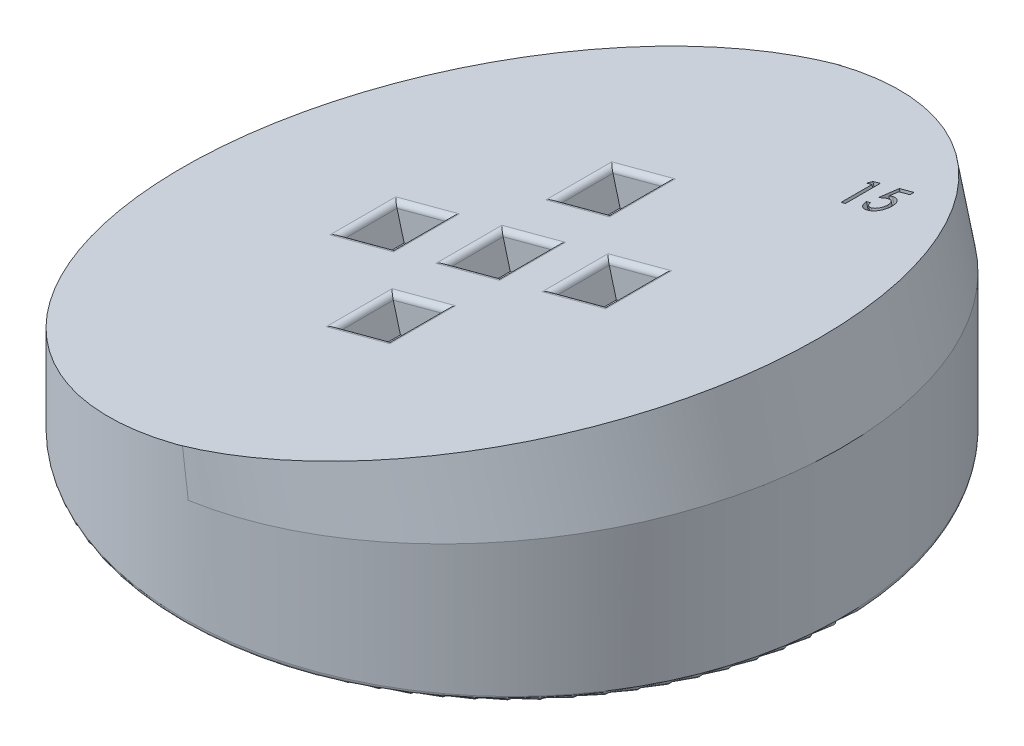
from build123d import *

# Parameters (mm, degrees)
SKETCH1_R           = 30
BOSS_EXTRUDE1_DEPTH = 50
SKETCH4_W           = 5
SKETCH4_H           = 5
CUT_EXTRUDE2_DEPTH  = 3
FILLET2_R           = 0.5
CUT_EXTRUDE10_DEPTH = 45
SKETCH15_W          = 5
SKETCH15_H          = 5
CUT_EXTRUDE11_DEPTH = 3
CUT_EXTRUDE13_DEPTH = 100
FILLET8_R           = 0.5
FILLET9_R           = 0.5
FILLET10_R          = 0.5
FILLET11_R          = 0.5
FILLET12_R          = 0.5
CUT_EXTRUDE14_DEPTH = 4


with BuildPart() as part:
    # Sketch1 → Boss-Extrude1 (new body)
    with BuildSketch(Plane(origin=(0, 0, 0), x_dir=(1, 0, 0), z_dir=(0, 1, 0))):
        with Locations(Location((0, 0, 0), (0, 0, 270))):
            Circle(SKETCH1_R)
    extrude(amount=BOSS_EXTRUDE1_DEPTH)

    # Sketch4 → Cut-Extrude2 (cut)
    with BuildSketch(Plane(origin=(0, 0, 0), x_dir=(-1, 0, 0), z_dir=(0, -1, 0))):
        Rectangle(SKETCH4_W, SKETCH4_H)
        with Locations((0, -10)):
            Rectangle(SKETCH4_W, SKETCH4_H)
        with Locations((10, 0)):
            Rectangle(SKETCH4_W, SKETCH4_H)
        with Locations((-10, 0)):
            Rectangle(SKETCH4_W, SKETCH4_H)
        with Locations((0, 10)):
            Rectangle(SKETCH4_W, SKETCH4_H)
    extrude(amount=-CUT_EXTRUDE2_DEPTH, mode=Mode.SUBTRACT)

    # Fillet2
    fillet2_edges = [part.edges().sort_by_distance(p)[0] for p in [
        (0, 0, -30),
        (-2.5, 0, 10),
        (0, 0, 7.5),
        (2.5, 0, 10),
        (0, 0, 12.5),
        (-12.5, 0, 0),
        (-10, 0, -2.5),
        (-7.5, 0, 0),
        (-10, 0, 2.5),
        (7.5, 0, 0),
        (10, 0, -2.5),
        (12.5, 0, 0),
        (10, 0, 2.5),
        (2.5, 0, -10),
        (0, 0, -7.5),
        (-2.5, 0, -10),
        (0, 0, -12.5),
        (-2.5, 0, 0),
        (0, 0, -2.5),
        (2.5, 0, 0),
        (0, 0, 2.5),
    ]]
    fillet(fillet2_edges, radius=FILLET2_R)

    # Sketch13 → Cut-Extrude10 (cut, symmetric)
    with BuildSketch(Plane.XY.offset(3.5)):
        Polygon((-30, 6), (30, 22.076951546), (30, 50), (-30, 50), align=None)
    extrude(amount=CUT_EXTRUDE10_DEPTH, both=True, mode=Mode.SUBTRACT)

    # Sketch15 → Cut-Extrude11 (cut)
    with BuildSketch(Plane(origin=(-3.509618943, 13.098076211, 0), x_dir=(0.96592582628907, 0.25881904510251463, 0), z_dir=(-0.2588190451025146, 0.9659258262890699, 0))):
        with Locations((-7.424860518, 0)):
            Rectangle(SKETCH15_W, SKETCH15_H)
        with Locations((2.575139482, 0)):
            Rectangle(SKETCH15_W, SKETCH15_H)
        with Locations((12.575139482, 0)):
            Rectangle(SKETCH15_W, SKETCH15_H)
        with Locations((2.575139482, -10)):
            Rectangle(SKETCH15_W, SKETCH15_H)
        with Locations((2.575139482, 10)):
            Rectangle(SKETCH15_W, SKETCH15_H)
    extrude(amount=-CUT_EXTRUDE11_DEPTH, mode=Mode.SUBTRACT)

    # Sketch24 → Cut-Extrude13 (cut)
    with BuildSketch(Plane(origin=(-3.509618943, 13.098076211, 0), x_dir=(0.96592582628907, 0.25881904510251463, 0), z_dir=(-0.25881904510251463, 0.96592582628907, 0))):
        with BuildLine():
            ThreePointArc((3.095110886, 29.995493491), (32.575139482, 0), (3.095110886, -29.995493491))
            add(Edge.make_bspline(
                [(3.633424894, -30), (3.364247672, -30), (3.095110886, -29.995493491)],
                knots=[4.71238898, 4.71238898, 4.71238898, 4.731572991, 4.731572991, 4.731572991], degree=2, weights=[1, 0.996422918, 0.99293321]))
            add(Edge.make_bspline(
                [(34.691710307, 0), (34.691710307, -30), (3.633424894, -30)],
                knots=[3.141592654, 3.141592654, 3.141592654, 4.71238898, 4.71238898, 4.71238898], degree=2, weights=[1, 0.707106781, 1]))
            add(Edge.make_bspline(
                [(3.095110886, 29.995493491), (3.364247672, 30), (3.633424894, 30), (34.691710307, 30), (34.691710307, 0)],
                knots=[1.551612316, 1.551612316, 1.551612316, 1.570796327, 1.570796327, 3.141592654, 3.141592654, 3.141592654], degree=2, weights=[0.99293321, 0.996422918, 1, 0.707106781, 1]))
        make_face()
    extrude(amount=-CUT_EXTRUDE13_DEPTH, mode=Mode.SUBTRACT)

    # Fillet8
    fillet8_edges = [part.edges().sort_by_distance(p)[0] for p in [
        (-3.437039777, 13.11752374, -10),
        (-1.022225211, 13.764571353, -7.5),
        (1.392589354, 14.411618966, -10),
        (-1.022225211, 13.764571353, -12.5),
    ]]
    fillet(fillet8_edges, radius=FILLET8_R)

    # Fillet9
    fillet9_edges = [part.edges().sort_by_distance(p)[0] for p in [
        (6.222218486, 15.705714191, 0),
        (8.637033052, 16.352761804, 2.5),
        (11.051847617, 16.999809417, 0),
        (8.637033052, 16.352761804, -2.5),
    ]]
    fillet(fillet9_edges, radius=FILLET9_R)

    # Fillet10
    fillet10_edges = [part.edges().sort_by_distance(p)[0] for p in [
        (-13.09629804, 10.529333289, 0),
        (-10.681483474, 11.176380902, 2.5),
        (-8.266668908, 11.823428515, 0),
        (-10.681483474, 11.176380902, -2.5),
    ]]
    fillet(fillet10_edges, radius=FILLET10_R)

    # Fillet11
    fillet11_edges = [part.edges().sort_by_distance(p)[0] for p in [
        (-3.437039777, 13.11752374, 10),
        (-1.022225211, 13.764571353, 12.5),
        (1.392589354, 14.411618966, 10),
        (-1.022225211, 13.764571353, 7.5),
    ]]
    fillet(fillet11_edges, radius=FILLET11_R)

    # Fillet12
    fillet12_edges = [part.edges().sort_by_distance(p)[0] for p in [
        (-3.437039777, 13.11752374, 0),
        (-1.022225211, 13.764571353, 2.5),
        (1.392589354, 14.411618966, 0),
        (-1.022225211, 13.764571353, -2.5),
    ]]
    fillet(fillet12_edges, radius=FILLET12_R)

    # Sketch25 → Cut-Extrude14 (cut)
    with BuildSketch(Plane(origin=(-3.509618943, 13.098076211, 0), x_dir=(0.96592582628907, 0.2588190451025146, 0), z_dir=(-0.2588190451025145, 0.9659258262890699, 0))):
        Polygon((18.573863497, 18.428545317), (19.264578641, 18.428545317), (19.264578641, 15.253545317), (18.857527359, 15.253545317), (18.857527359, 18.062199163), (18.36906582, 18.062199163), align=None)
        with BuildLine():
            Line((22.439578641, 18.428545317), (22.439578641, 18.062199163))
            Line((22.439578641, 18.062199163), (21.39650973, 18.062199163))
            Line((21.39650973, 18.062199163), (21.226057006, 17.309790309))
            add(Edge.make_bspline(
                [(21.226057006, 17.309790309), (21.245942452, 17.319373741), (21.286866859, 17.33909652), (21.355286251, 17.356281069), (21.429570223, 17.3683721), (21.481465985, 17.369582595), (21.508448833, 17.370211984)],
                knots=[0, 0, 0, 0, 0.906577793, 1.865744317, 2.890308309, 4, 4, 4, 4], degree=3))
            add(Edge.make_bspline(
                [(21.508448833, 17.370211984), (21.546664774, 17.369512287), (21.621695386, 17.368138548), (21.731046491, 17.352787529), (21.835247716, 17.329789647), (21.933441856, 17.295481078), (22.026750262, 17.253245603), (22.114160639, 17.200394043), (22.1955822, 17.137822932), (22.270906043, 17.066597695), (22.339557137, 16.989016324), (22.39851911, 16.905235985), (22.449629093, 16.817704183), (22.490141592, 16.724908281), (22.522150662, 16.627808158), (22.544914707, 16.525997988), (22.559386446, 16.419782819), (22.560917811, 16.347330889), (22.561694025, 16.310606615)],
                knots=[0, 0, 0, 0, 1.094894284, 2.149641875, 3.159658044, 4.149576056, 5.125966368, 6.091225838, 7.071072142, 8.064343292, 9.05924964, 10.03573454, 10.996966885, 11.96032995, 12.932910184, 13.923798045, 14.947619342, 16, 16, 16, 16], degree=3))
            add(Edge.make_bspline(
                [(22.561694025, 16.310606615), (22.561097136, 16.284944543), (22.559916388, 16.234180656), (22.553763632, 16.158698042), (22.542019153, 16.084843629), (22.526425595, 16.012046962), (22.504938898, 15.940932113), (22.480479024, 15.870553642), (22.450428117, 15.802033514), (22.416120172, 15.735400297), (22.378055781, 15.671141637), (22.336145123, 15.610037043), (22.29029244, 15.552575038), (22.240335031, 15.499236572), (22.187638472, 15.448649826), (22.13082813, 15.40213507), (22.070065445, 15.359496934), (22.006217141, 15.320269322), (21.93931374, 15.284830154), (21.868962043, 15.255487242), (21.796908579, 15.228826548), (21.721371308, 15.208863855), (21.643774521, 15.192066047), (21.563186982, 15.180918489), (21.480173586, 15.173650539), (21.423874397, 15.172646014), (21.395237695, 15.172135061)],
                knots=[0, 0, 0, 0, 1.012275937, 2.002451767, 2.98397589, 3.959820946, 4.936095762, 5.911940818, 6.896771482, 7.884012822, 8.866284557, 9.840372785, 10.804070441, 11.762530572, 12.720625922, 13.68308951, 14.655094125, 15.646011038, 16.637104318, 17.63729087, 18.650257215, 19.66446511, 20.715636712, 21.77986274, 22.870722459, 24, 24, 24, 24], degree=3))
            add(Edge.make_bspline(
                [(21.395237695, 15.172135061), (21.362984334, 15.172909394), (21.29935512, 15.174436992), (21.205902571, 15.185271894), (21.116250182, 15.203655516), (21.030777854, 15.229971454), (20.948849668, 15.262978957), (20.871164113, 15.303811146), (20.797419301, 15.352101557), (20.727520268, 15.406929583), (20.663769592, 15.469473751), (20.605005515, 15.536804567), (20.554938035, 15.611400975), (20.510893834, 15.691204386), (20.473050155, 15.776863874), (20.442943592, 15.86854185), (20.418869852, 15.965891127), (20.409247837, 16.033194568), (20.40432223, 16.067647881)],
                knots=[0, 0, 0, 0, 1.049569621, 2.070583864, 3.057046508, 4.023914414, 4.977170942, 5.927726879, 6.875021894, 7.842677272, 8.813672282, 9.777581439, 10.74592533, 11.731059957, 12.74126976, 13.788569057, 14.867946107, 16, 16, 16, 16], degree=3))
            Line((20.40432223, 16.067647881), (20.801833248, 16.067647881))
            add(Edge.make_bspline(
                [(20.801833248, 16.067647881), (20.809398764, 16.03437428), (20.82360101, 15.971911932), (20.854111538, 15.886802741), (20.886812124, 15.814416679), (20.926807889, 15.755217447), (20.972712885, 15.706624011), (21.023664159, 15.664443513), (21.079640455, 15.626606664), (21.141264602, 15.595198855), (21.206192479, 15.56975347), (21.273654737, 15.551994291), (21.342288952, 15.540827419), (21.388624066, 15.53926289), (21.411774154, 15.538481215)],
                knots=[0, 0, 0, 0, 1.385459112, 2.600831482, 3.66841355, 4.605180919, 5.48910649, 6.376050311, 7.288896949, 8.229144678, 9.181161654, 10.117453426, 11.059436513, 12, 12, 12, 12], degree=3))
            add(Edge.make_bspline(
                [(21.411774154, 15.538481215), (21.436817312, 15.539321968), (21.486260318, 15.540981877), (21.55909787, 15.550918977), (21.628757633, 15.569299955), (21.696245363, 15.593125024), (21.760382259, 15.625575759), (21.822742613, 15.663466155), (21.881052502, 15.7099945), (21.936941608, 15.761728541), (21.988130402, 15.819032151), (22.032703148, 15.880946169), (22.070725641, 15.946227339), (22.101026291, 16.015309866), (22.125617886, 16.08756074), (22.142521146, 16.163473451), (22.153067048, 16.242889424), (22.154110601, 16.297004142), (22.154642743, 16.324599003)],
                knots=[0, 0, 0, 0, 0.99750234, 1.969380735, 2.919490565, 3.862219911, 4.813679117, 5.776605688, 6.762898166, 7.778387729, 8.806918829, 9.816812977, 10.811632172, 11.809420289, 12.815921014, 13.846113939, 14.901663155, 16, 16, 16, 16], degree=3))
            add(Edge.make_bspline(
                [(22.154642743, 16.324599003), (22.154010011, 16.349219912), (22.152767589, 16.397565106), (22.143666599, 16.468223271), (22.129230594, 16.535622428), (22.108253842, 16.599128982), (22.081289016, 16.659094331), (22.048130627, 16.715134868), (22.008879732, 16.767562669), (21.964738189, 16.816547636), (21.914768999, 16.860316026), (21.861116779, 16.899487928), (21.802152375, 16.931169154), (21.740002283, 16.958280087), (21.673228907, 16.97809377), (21.603028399, 16.994059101), (21.528121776, 17.001729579), (21.476872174, 17.003141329), (21.450571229, 17.00386583)],
                knots=[0, 0, 0, 0, 1.071512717, 2.104004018, 3.095982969, 4.067795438, 5.009520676, 5.952827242, 6.895998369, 7.856350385, 8.817411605, 9.782937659, 10.74115891, 11.725120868, 12.729302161, 13.768330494, 14.854722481, 16, 16, 16, 16], degree=3))
            add(Edge.make_bspline(
                [(21.450571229, 17.00386583), (21.42808031, 17.003326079), (21.380862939, 17.002192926), (21.30697615, 16.993999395), (21.22657267, 16.98111212), (21.139779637, 16.963288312), (21.046513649, 16.940067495), (20.946661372, 16.91192956), (20.84011232, 16.879095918), (20.767416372, 16.853983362), (20.729963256, 16.841045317)],
                knots=[0, 0, 0, 0, 0.727614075, 1.527550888, 2.402655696, 3.361819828, 4.39328773, 5.511706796, 6.718025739, 8, 8, 8, 8], degree=3))
            Line((20.729963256, 16.841045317), (21.063236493, 18.428545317))
            Line((21.063236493, 18.428545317), (22.439578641, 18.428545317))
        make_face()
    extrude(amount=-CUT_EXTRUDE14_DEPTH, mode=Mode.SUBTRACT)


solid = part.part
